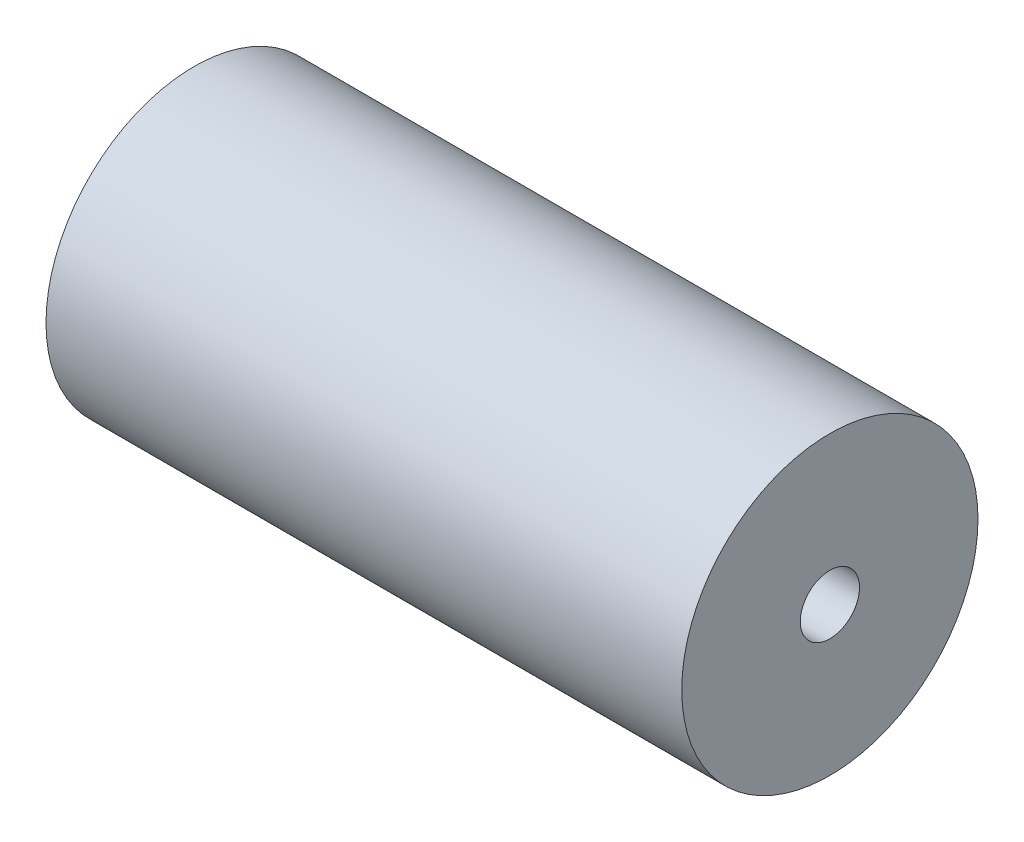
ISO-10303-21;
HEADER;
FILE_DESCRIPTION(('STEP AP214'),'2;1');
FILE_NAME('part.step','',(''),(''),'','','');
FILE_SCHEMA(('AUTOMOTIVE_DESIGN { 1 0 10303 214 1 1 1 1 }'));
ENDSEC;
DATA;
#1=APPLICATION_CONTEXT('core data for automotive mechanical design processes');
#2=APPLICATION_PROTOCOL_DEFINITION('international standard','automotive_design',2000,#1);
#3=PRODUCT_CONTEXT('',#1,'mechanical');
#4=PRODUCT('Part','Part','',(#3));
#5=PRODUCT_RELATED_PRODUCT_CATEGORY('part','',(#4));
#6=PRODUCT_DEFINITION_FORMATION('','',#4);
#7=PRODUCT_DEFINITION_CONTEXT('part definition',#1,'design');
#8=PRODUCT_DEFINITION('design','',#6,#7);
#9=PRODUCT_DEFINITION_SHAPE('','',#8);
#10=(LENGTH_UNIT() NAMED_UNIT(*) SI_UNIT(.MILLI.,.METRE.));
#11=(NAMED_UNIT(*) PLANE_ANGLE_UNIT() SI_UNIT($,.RADIAN.));
#12=(NAMED_UNIT(*) SI_UNIT($,.STERADIAN.) SOLID_ANGLE_UNIT());
#13=UNCERTAINTY_MEASURE_WITH_UNIT(LENGTH_MEASURE(1.E-05),#10,'distance_accuracy_value','');
#14=(GEOMETRIC_REPRESENTATION_CONTEXT(3) GLOBAL_UNCERTAINTY_ASSIGNED_CONTEXT((#13)) GLOBAL_UNIT_ASSIGNED_CONTEXT((#10,
#11,#12)) REPRESENTATION_CONTEXT('',''));
#15=CARTESIAN_POINT('',(0.,0.,0.));
#16=DIRECTION('',(0.,0.,1.));
#17=DIRECTION('',(1.,0.,0.));
#18=AXIS2_PLACEMENT_3D('',#15,#16,#17);
#19=CARTESIAN_POINT('',(107.3,0.,0.));
#20=DIRECTION('',(1.,0.,0.));
#21=DIRECTION('',(0.,0.,-1.));
#22=AXIS2_PLACEMENT_3D('',#19,#20,#21);
#23=PLANE('',#22);
#24=CARTESIAN_POINT('',(107.3,0.,0.));
#25=DIRECTION('',(1.,0.,0.));
#26=DIRECTION('',(0.,0.,-1.));
#27=AXIS2_PLACEMENT_3D('',#24,#25,#26);
#28=CIRCLE('',#27,25.);
#29=CARTESIAN_POINT('',(107.3,0.,-25.));
#30=VERTEX_POINT('',#29);
#31=EDGE_CURVE('E10',#30,#30,#28,.T.);
#32=ORIENTED_EDGE('',*,*,#31,.T.);
#33=EDGE_LOOP('',(#32));
#34=FACE_BOUND('',#33,.T.);
#35=CARTESIAN_POINT('',(107.3,0.,0.));
#36=DIRECTION('',(1.,0.,0.));
#37=DIRECTION('',(0.,0.,-1.));
#38=AXIS2_PLACEMENT_3D('',#35,#36,#37);
#39=CIRCLE('',#38,5.);
#40=CARTESIAN_POINT('',(107.3,0.,-5.));
#41=VERTEX_POINT('',#40);
#42=EDGE_CURVE('E42',#41,#41,#39,.T.);
#43=ORIENTED_EDGE('',*,*,#42,.F.);
#44=EDGE_LOOP('',(#43));
#45=FACE_BOUND('',#44,.T.);
#46=ADVANCED_FACE('F31',(#34,#45),#23,.T.);
#47=CARTESIAN_POINT('',(0.,0.,0.));
#48=DIRECTION('',(1.,0.,0.));
#49=DIRECTION('',(0.,0.,-1.));
#50=AXIS2_PLACEMENT_3D('',#47,#48,#49);
#51=PLANE('',#50);
#52=CARTESIAN_POINT('',(0.,0.,0.));
#53=DIRECTION('',(1.,0.,0.));
#54=DIRECTION('',(0.,0.,-1.));
#55=AXIS2_PLACEMENT_3D('',#52,#53,#54);
#56=CIRCLE('',#55,25.);
#57=CARTESIAN_POINT('',(0.,0.,-25.));
#58=VERTEX_POINT('',#57);
#59=EDGE_CURVE('E35',#58,#58,#56,.T.);
#60=ORIENTED_EDGE('',*,*,#59,.F.);
#61=EDGE_LOOP('',(#60));
#62=FACE_BOUND('',#61,.T.);
#63=CARTESIAN_POINT('',(0.,0.,0.));
#64=DIRECTION('',(1.,0.,0.));
#65=DIRECTION('',(0.,0.,-1.));
#66=AXIS2_PLACEMENT_3D('',#63,#64,#65);
#67=CIRCLE('',#66,5.);
#68=CARTESIAN_POINT('',(0.,0.,-5.));
#69=VERTEX_POINT('',#68);
#70=EDGE_CURVE('E44',#69,#69,#67,.T.);
#71=ORIENTED_EDGE('',*,*,#70,.T.);
#72=EDGE_LOOP('',(#71));
#73=FACE_BOUND('',#72,.T.);
#74=ADVANCED_FACE('F54',(#62,#73),#51,.F.);
#75=CARTESIAN_POINT('',(107.3,0.,0.));
#76=DIRECTION('',(-1.,0.,0.));
#77=DIRECTION('',(0.,0.,1.));
#78=AXIS2_PLACEMENT_3D('',#75,#76,#77);
#79=CYLINDRICAL_SURFACE('',#78,25.);
#80=ORIENTED_EDGE('',*,*,#31,.F.);
#81=EDGE_LOOP('',(#80));
#82=FACE_BOUND('',#81,.T.);
#83=ORIENTED_EDGE('',*,*,#59,.T.);
#84=EDGE_LOOP('',(#83));
#85=FACE_BOUND('',#84,.T.);
#86=ADVANCED_FACE('F33',(#82,#85),#79,.T.);
#87=CARTESIAN_POINT('',(107.3,0.,0.));
#88=DIRECTION('',(-1.,0.,0.));
#89=DIRECTION('',(0.,0.,1.));
#90=AXIS2_PLACEMENT_3D('',#87,#88,#89);
#91=CYLINDRICAL_SURFACE('',#90,5.);
#92=ORIENTED_EDGE('',*,*,#42,.T.);
#93=EDGE_LOOP('',(#92));
#94=FACE_BOUND('',#93,.T.);
#95=ORIENTED_EDGE('',*,*,#70,.F.);
#96=EDGE_LOOP('',(#95));
#97=FACE_BOUND('',#96,.T.);
#98=ADVANCED_FACE('F50',(#94,#97),#91,.F.);
#99=CLOSED_SHELL('',(#46,#74,#86,#98));
#100=MANIFOLD_SOLID_BREP('B2',#99);
#101=ADVANCED_BREP_SHAPE_REPRESENTATION('',(#18,#100),#14);
#102=SHAPE_DEFINITION_REPRESENTATION(#9,#101);
ENDSEC;
END-ISO-10303-21;
